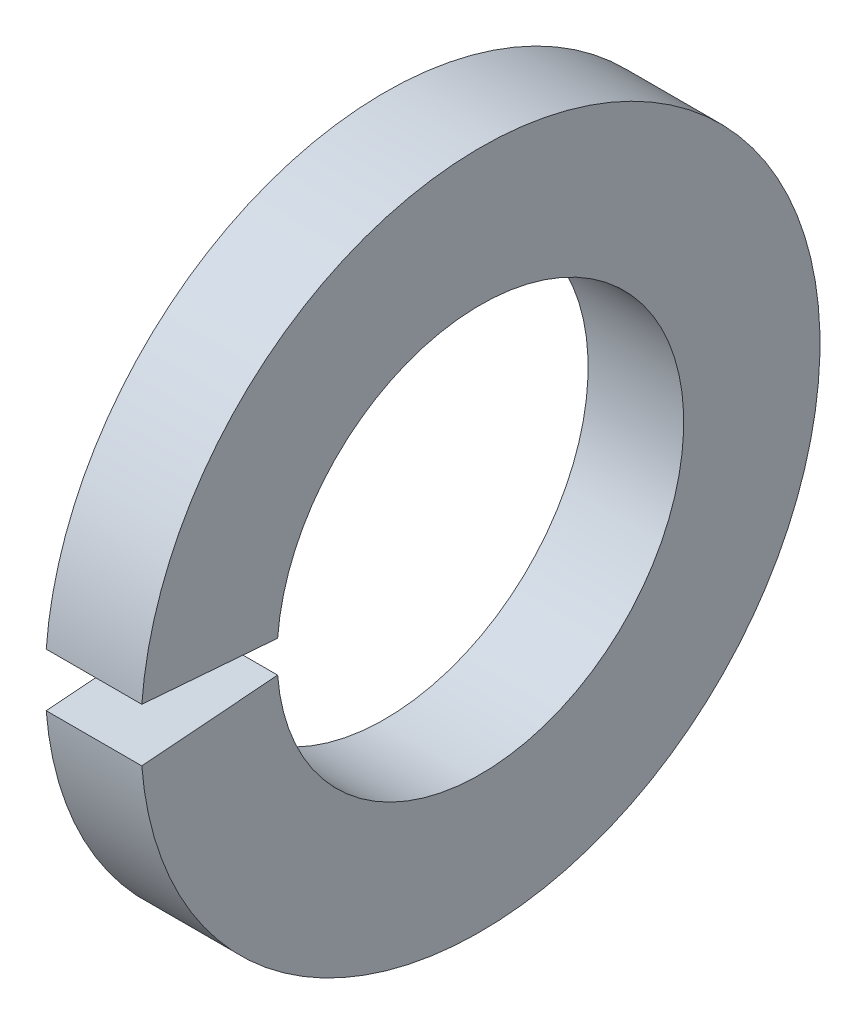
ISO-10303-21;
HEADER;
FILE_DESCRIPTION(('STEP AP214'),'2;1');
FILE_NAME('part.step','',(''),(''),'','','');
FILE_SCHEMA(('AUTOMOTIVE_DESIGN { 1 0 10303 214 1 1 1 1 }'));
ENDSEC;
DATA;
#1=APPLICATION_CONTEXT('core data for automotive mechanical design processes');
#2=APPLICATION_PROTOCOL_DEFINITION('international standard','automotive_design',2000,#1);
#3=PRODUCT_CONTEXT('',#1,'mechanical');
#4=PRODUCT('Part','Part','',(#3));
#5=PRODUCT_RELATED_PRODUCT_CATEGORY('part','',(#4));
#6=PRODUCT_DEFINITION_FORMATION('','',#4);
#7=PRODUCT_DEFINITION_CONTEXT('part definition',#1,'design');
#8=PRODUCT_DEFINITION('design','',#6,#7);
#9=PRODUCT_DEFINITION_SHAPE('','',#8);
#10=(LENGTH_UNIT() NAMED_UNIT(*) SI_UNIT(.MILLI.,.METRE.));
#11=(NAMED_UNIT(*) PLANE_ANGLE_UNIT() SI_UNIT($,.RADIAN.));
#12=(NAMED_UNIT(*) SI_UNIT($,.STERADIAN.) SOLID_ANGLE_UNIT());
#13=UNCERTAINTY_MEASURE_WITH_UNIT(LENGTH_MEASURE(1.E-05),#10,'distance_accuracy_value','');
#14=(GEOMETRIC_REPRESENTATION_CONTEXT(3) GLOBAL_UNCERTAINTY_ASSIGNED_CONTEXT((#13)) GLOBAL_UNIT_ASSIGNED_CONTEXT((#10,
#11,#12)) REPRESENTATION_CONTEXT('',''));
#15=CARTESIAN_POINT('',(0.,0.,0.));
#16=DIRECTION('',(0.,0.,1.));
#17=DIRECTION('',(1.,0.,0.));
#18=AXIS2_PLACEMENT_3D('',#15,#16,#17);
#19=CARTESIAN_POINT('',(-34.925,0.,0.));
#20=DIRECTION('',(-1.,0.,0.));
#21=DIRECTION('',(0.,0.,1.));
#22=AXIS2_PLACEMENT_3D('',#19,#20,#21);
#23=CYLINDRICAL_SURFACE('',#22,2.54);
#24=CARTESIAN_POINT('',(0.,0.,0.));
#25=DIRECTION('',(-1.,0.,0.));
#26=DIRECTION('',(0.,0.,1.));
#27=AXIS2_PLACEMENT_3D('',#24,#25,#26);
#28=CIRCLE('',#27,2.54);
#29=CARTESIAN_POINT('',(-6.10622663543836E-13,0.199286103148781,2.53217002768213));
#30=VERTEX_POINT('',#29);
#31=CARTESIAN_POINT('',(-6.10622663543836E-13,-0.199286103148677,2.53217002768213));
#32=VERTEX_POINT('',#31);
#33=EDGE_CURVE('E87',#30,#32,#28,.T.);
#34=ORIENTED_EDGE('',*,*,#33,.F.);
#35=DIRECTION('',(-1.,0.,0.));
#36=VECTOR('',#35,1.);
#37=CARTESIAN_POINT('',(-34.9250000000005,0.199286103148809,2.53217002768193));
#38=LINE('',#37,#36);
#39=CARTESIAN_POINT('',(-1.19380000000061,0.199286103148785,2.53217002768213));
#40=VERTEX_POINT('',#39);
#41=EDGE_CURVE('E101',#30,#40,#38,.T.);
#42=ORIENTED_EDGE('',*,*,#41,.T.);
#43=CARTESIAN_POINT('',(-1.19379999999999,0.,0.));
#44=DIRECTION('',(-1.,0.,0.));
#45=DIRECTION('',(0.,0.,1.));
#46=AXIS2_PLACEMENT_3D('',#43,#44,#45);
#47=CIRCLE('',#46,2.54);
#48=CARTESIAN_POINT('',(-1.19380000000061,-0.199286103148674,2.53217002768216));
#49=VERTEX_POINT('',#48);
#50=EDGE_CURVE('E89',#40,#49,#47,.T.);
#51=ORIENTED_EDGE('',*,*,#50,.T.);
#52=DIRECTION('',(-1.,0.,0.));
#53=VECTOR('',#52,1.);
#54=CARTESIAN_POINT('',(-34.9250000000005,-0.199286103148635,2.53217002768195));
#55=LINE('',#54,#53);
#56=EDGE_CURVE('E57',#32,#49,#55,.T.);
#57=ORIENTED_EDGE('',*,*,#56,.F.);
#58=EDGE_LOOP('',(#34,#42,#51,#57));
#59=FACE_BOUND('',#58,.T.);
#60=ADVANCED_FACE('F36',(#59),#23,.F.);
#61=CARTESIAN_POINT('',(0.,2.5400000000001,0.));
#62=DIRECTION('',(-1.,0.,0.));
#63=DIRECTION('',(0.,0.,1.));
#64=AXIS2_PLACEMENT_3D('',#61,#62,#63);
#65=PLANE('',#64);
#66=CARTESIAN_POINT('',(0.,0.,0.));
#67=DIRECTION('',(-1.,0.,0.));
#68=DIRECTION('',(0.,0.,1.));
#69=AXIS2_PLACEMENT_3D('',#66,#67,#68);
#70=CIRCLE('',#69,4.2418);
#71=CARTESIAN_POINT('',(-6.10622663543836E-13,0.332807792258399,4.22872394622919));
#72=VERTEX_POINT('',#71);
#73=CARTESIAN_POINT('',(-6.10622663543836E-13,-0.332807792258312,4.22872394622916));
#74=VERTEX_POINT('',#73);
#75=EDGE_CURVE('E93',#72,#74,#70,.T.);
#76=ORIENTED_EDGE('',*,*,#75,.F.);
#77=DIRECTION('',(0.,0.0784590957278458,0.996917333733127));
#78=VECTOR('',#77,1.);
#79=CARTESIAN_POINT('',(0.,0.,0.));
#80=LINE('',#79,#78);
#81=EDGE_CURVE('E81',#30,#72,#80,.T.);
#82=ORIENTED_EDGE('',*,*,#81,.F.);
#83=ORIENTED_EDGE('',*,*,#33,.T.);
#84=DIRECTION('',(0.,-0.0784590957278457,0.996917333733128));
#85=VECTOR('',#84,1.);
#86=CARTESIAN_POINT('',(0.,0.,0.));
#87=LINE('',#86,#85);
#88=EDGE_CURVE('E73',#32,#74,#87,.T.);
#89=ORIENTED_EDGE('',*,*,#88,.T.);
#90=EDGE_LOOP('',(#76,#82,#83,#89));
#91=FACE_BOUND('',#90,.T.);
#92=ADVANCED_FACE('F92',(#91),#65,.F.);
#93=CARTESIAN_POINT('',(-34.925,0.,0.));
#94=DIRECTION('',(-1.,0.,0.));
#95=DIRECTION('',(0.,0.,1.));
#96=AXIS2_PLACEMENT_3D('',#93,#94,#95);
#97=CYLINDRICAL_SURFACE('',#96,4.2418);
#98=CARTESIAN_POINT('',(-1.19379999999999,0.,0.));
#99=DIRECTION('',(-1.,0.,0.));
#100=DIRECTION('',(0.,0.,1.));
#101=AXIS2_PLACEMENT_3D('',#98,#99,#100);
#102=CIRCLE('',#101,4.2418);
#103=CARTESIAN_POINT('',(-1.19380000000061,0.332807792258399,4.22872394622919));
#104=VERTEX_POINT('',#103);
#105=CARTESIAN_POINT('',(-1.19380000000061,-0.332807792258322,4.22872394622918));
#106=VERTEX_POINT('',#105);
#107=EDGE_CURVE('E95',#104,#106,#102,.T.);
#108=ORIENTED_EDGE('',*,*,#107,.F.);
#109=DIRECTION('',(-1.,0.,0.));
#110=VECTOR('',#109,1.);
#111=CARTESIAN_POINT('',(-34.9250000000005,0.332807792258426,4.22872394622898));
#112=LINE('',#111,#110);
#113=EDGE_CURVE('E50',#104,#72,#112,.F.);
#114=ORIENTED_EDGE('',*,*,#113,.T.);
#115=ORIENTED_EDGE('',*,*,#75,.T.);
#116=DIRECTION('',(-1.,0.,0.));
#117=VECTOR('',#116,1.);
#118=CARTESIAN_POINT('',(-34.9250000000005,-0.332807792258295,4.22872394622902));
#119=LINE('',#118,#117);
#120=EDGE_CURVE('E76',#106,#74,#119,.F.);
#121=ORIENTED_EDGE('',*,*,#120,.F.);
#122=EDGE_LOOP('',(#108,#114,#115,#121));
#123=FACE_BOUND('',#122,.T.);
#124=ADVANCED_FACE('F108',(#123),#97,.T.);
#125=CARTESIAN_POINT('',(-1.19379999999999,4.24180000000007,0.));
#126=DIRECTION('',(1.,0.,0.));
#127=DIRECTION('',(0.,0.,-1.));
#128=AXIS2_PLACEMENT_3D('',#125,#126,#127);
#129=PLANE('',#128);
#130=ORIENTED_EDGE('',*,*,#50,.F.);
#131=DIRECTION('',(0.,0.0784590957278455,0.996917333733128));
#132=VECTOR('',#131,1.);
#133=CARTESIAN_POINT('',(-1.19379999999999,0.0261117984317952,0.331781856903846));
#134=LINE('',#133,#132);
#135=EDGE_CURVE('E11',#40,#104,#134,.T.);
#136=ORIENTED_EDGE('',*,*,#135,.T.);
#137=ORIENTED_EDGE('',*,*,#107,.T.);
#138=DIRECTION('',(0.,-0.0784590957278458,0.996917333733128));
#139=VECTOR('',#138,1.);
#140=CARTESIAN_POINT('',(-1.19379999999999,0.0261117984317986,-0.331781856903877));
#141=LINE('',#140,#139);
#142=EDGE_CURVE('E43',#49,#106,#141,.T.);
#143=ORIENTED_EDGE('',*,*,#142,.F.);
#144=EDGE_LOOP('',(#130,#136,#137,#143));
#145=FACE_BOUND('',#144,.T.);
#146=ADVANCED_FACE('F110',(#145),#129,.F.);
#147=CARTESIAN_POINT('',(-1.19379999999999,0.,0.));
#148=DIRECTION('',(0.,0.996917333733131,0.0784590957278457));
#149=DIRECTION('',(0.,-0.0784590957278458,0.996917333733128));
#150=AXIS2_PLACEMENT_3D('',#147,#148,#149);
#151=PLANE('',#150);
#152=ORIENTED_EDGE('',*,*,#56,.T.);
#153=ORIENTED_EDGE('',*,*,#142,.T.);
#154=ORIENTED_EDGE('',*,*,#120,.T.);
#155=ORIENTED_EDGE('',*,*,#88,.F.);
#156=EDGE_LOOP('',(#152,#153,#154,#155));
#157=FACE_BOUND('',#156,.T.);
#158=ADVANCED_FACE('F74',(#157),#151,.T.);
#159=CARTESIAN_POINT('',(-1.19379999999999,0.,0.));
#160=DIRECTION('',(0.,0.996917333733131,-0.0784590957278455));
#161=DIRECTION('',(0.,0.0784590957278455,0.996917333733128));
#162=AXIS2_PLACEMENT_3D('',#159,#160,#161);
#163=PLANE('',#162);
#164=ORIENTED_EDGE('',*,*,#81,.T.);
#165=ORIENTED_EDGE('',*,*,#113,.F.);
#166=ORIENTED_EDGE('',*,*,#135,.F.);
#167=ORIENTED_EDGE('',*,*,#41,.F.);
#168=EDGE_LOOP('',(#164,#165,#166,#167));
#169=FACE_BOUND('',#168,.T.);
#170=ADVANCED_FACE('F105',(#169),#163,.F.);
#171=CLOSED_SHELL('',(#60,#92,#124,#146,#158,#170));
#172=MANIFOLD_SOLID_BREP('B2',#171);
#173=ADVANCED_BREP_SHAPE_REPRESENTATION('',(#18,#172),#14);
#174=SHAPE_DEFINITION_REPRESENTATION(#9,#173);
ENDSEC;
END-ISO-10303-21;
